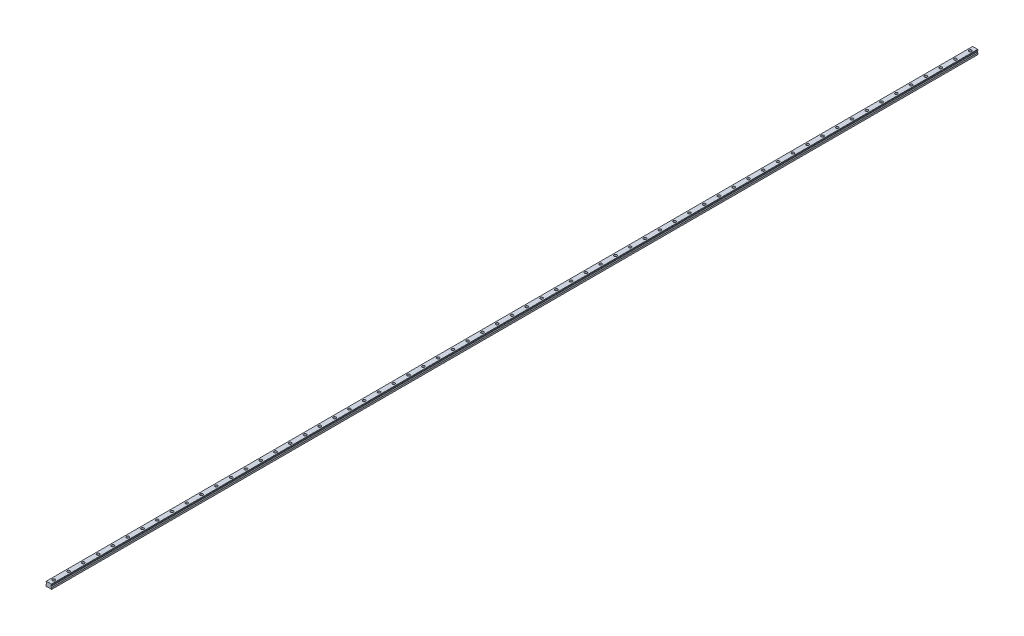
from build123d import *

# Parameters (mm, degrees)
SKETCH1_W           = 23
SKETCH1_H           = 19.2
BOSS_EXTRUDE1_DEPTH = 1880
CUT_EXTRUDE1_DEPTH  = 3761.066607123
CHAMFER1_SIZE       = 1.25
FILLET1_R           = 1.25
CUT_EXTRUDE2_DEPTH  = 3761.066607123
SKETCH4_R           = 5.5
SKETCH4_R_2         = 3.5
CUT_EXTRUDE3_DEPTH  = 9
SKETCH4_2_R         = 3.5
CUT_EXTRUDE4_DEPTH  = 1881.133210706
LPATTERN1_COUNT     = 63
LPATTERN1_PITCH     = 60


with BuildPart() as part:
    # Sketch1 → Boss-Extrude1 (new, symmetric)
    with BuildSketch(Plane.XY):
        with Locations((0, 9.6)):
            Rectangle(SKETCH1_W, SKETCH1_H)
    extrude(amount=BOSS_EXTRUDE1_DEPTH, both=True)

    # Sketch2 → Cut-Extrude1 (cut, through all)
    with BuildSketch(Plane.XY.offset(1880)):
        Polygon((-11.5, 16.7), (-11.5, 7.95), (-8.583333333, 10.866666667), (-8.583333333, 13.783333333), align=None)
        Polygon((8.583333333, 13.783333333), (11.5, 16.7), (11.5, 7.95), (8.583333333, 10.866666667), align=None)
    extrude(amount=-CUT_EXTRUDE1_DEPTH, mode=Mode.SUBTRACT)

    # Chamfer1
    chamfer1_edges = [part.edges().sort_by_distance(p)[0] for p in [
        (-11.5, 19.2, 0),
        (11.5, 19.2, 0),
        (11.5, 0, 0),
        (-11.5, 0, 0),
    ]]
    chamfer(chamfer1_edges, length=CHAMFER1_SIZE)

    # Fillet1
    fillet1_edges = [part.edges().sort_by_distance(p)[0] for p in [
        (-8.583333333, 13.783333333, 0),
        (-8.583333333, 10.866666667, 0),
        (8.583333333, 10.866666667, 0),
        (8.583333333, 13.783333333, 0),
    ]]
    fillet(fillet1_edges, radius=FILLET1_R)

    # Sketch3 → Cut-Extrude2 (cut, through all)
    with BuildSketch(Plane.XY.offset(1880)):
        Polygon((-7, 0), (-5.75, 1.25), (5.75, 1.25), (7, 0), align=None)
    extrude(amount=-CUT_EXTRUDE2_DEPTH, mode=Mode.SUBTRACT)

    # Sketch4 → Cut-Extrude3 (cut)
    with BuildSketch(Plane(origin=(0, 19.2, 0), x_dir=(1, 0, 0), z_dir=(0, 1, 0))):
        with Locations(Location((0, -1860, 0), (0, 0, 270))):
            Circle(SKETCH4_R)
        with Locations(Location((0, -1860, 0), (0, 0, 270))):
            Circle(SKETCH4_R_2, mode=Mode.SUBTRACT)
    cut_extrude3 = extrude(amount=-CUT_EXTRUDE3_DEPTH, mode=Mode.SUBTRACT)

    # Sketch4_2 → Cut-Extrude4 (cut, through all)
    with BuildSketch(Plane(origin=(0, 19.2, 0), x_dir=(1, 0, 0), z_dir=(0, 1, 0))):
        with Locations(Location((0, -1860, 0), (0, 0, 270))):
            Circle(SKETCH4_2_R)
    cut_extrude4 = extrude(amount=-CUT_EXTRUDE4_DEPTH, mode=Mode.SUBTRACT)

    # LPattern1: Cut-Extrude3, Cut-Extrude4 ×63
    with Locations(*[(0, 0, -i * LPATTERN1_PITCH) for i in range(1, LPATTERN1_COUNT)]):
        add(cut_extrude3, mode=Mode.SUBTRACT)
        add(cut_extrude4, mode=Mode.SUBTRACT)


solid = part.part
